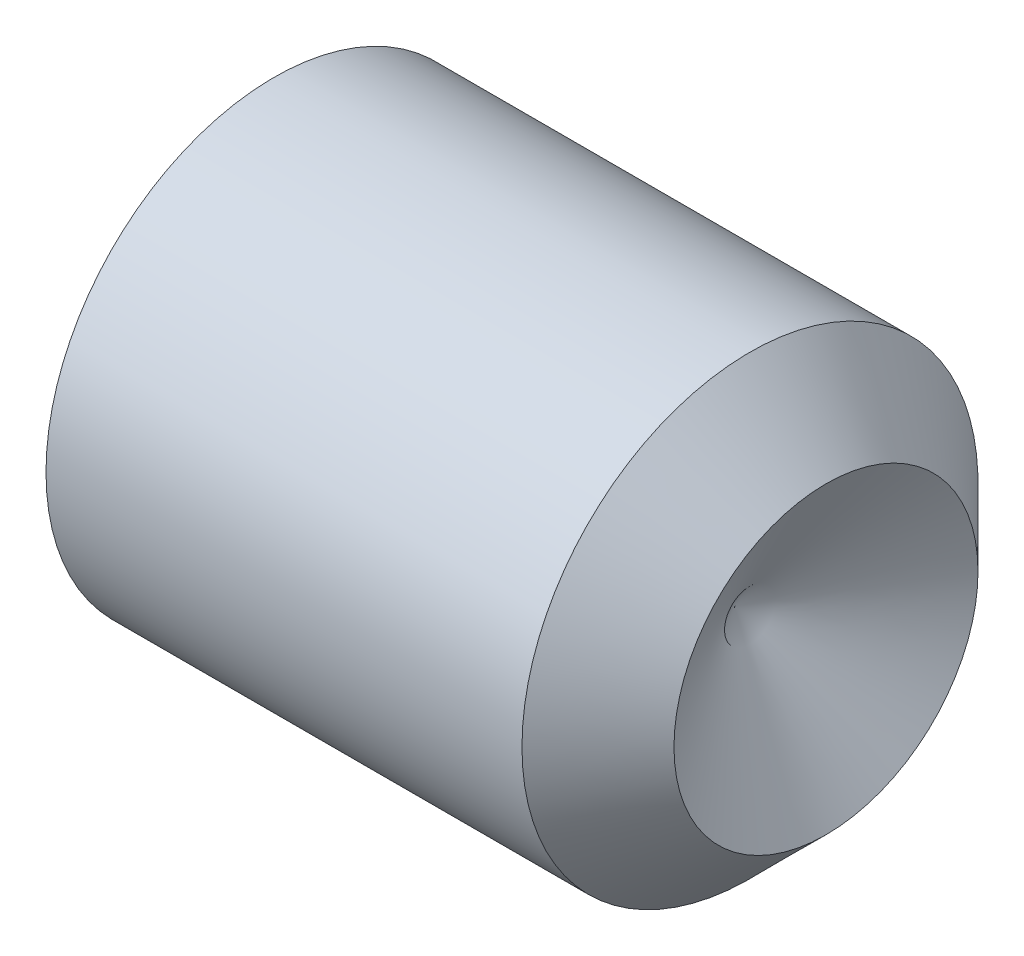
ISO-10303-21;
HEADER;
FILE_DESCRIPTION(('STEP AP214'),'2;1');
FILE_NAME('part.step','',(''),(''),'','','');
FILE_SCHEMA(('AUTOMOTIVE_DESIGN { 1 0 10303 214 1 1 1 1 }'));
ENDSEC;
DATA;
#1=APPLICATION_CONTEXT('core data for automotive mechanical design processes');
#2=APPLICATION_PROTOCOL_DEFINITION('international standard','automotive_design',2000,#1);
#3=PRODUCT_CONTEXT('',#1,'mechanical');
#4=PRODUCT('Part','Part','',(#3));
#5=PRODUCT_RELATED_PRODUCT_CATEGORY('part','',(#4));
#6=PRODUCT_DEFINITION_FORMATION('','',#4);
#7=PRODUCT_DEFINITION_CONTEXT('part definition',#1,'design');
#8=PRODUCT_DEFINITION('design','',#6,#7);
#9=PRODUCT_DEFINITION_SHAPE('','',#8);
#10=(LENGTH_UNIT() NAMED_UNIT(*) SI_UNIT(.MILLI.,.METRE.));
#11=(NAMED_UNIT(*) PLANE_ANGLE_UNIT() SI_UNIT($,.RADIAN.));
#12=(NAMED_UNIT(*) SI_UNIT($,.STERADIAN.) SOLID_ANGLE_UNIT());
#13=UNCERTAINTY_MEASURE_WITH_UNIT(LENGTH_MEASURE(1.E-05),#10,'distance_accuracy_value','');
#14=(GEOMETRIC_REPRESENTATION_CONTEXT(3) GLOBAL_UNCERTAINTY_ASSIGNED_CONTEXT((#13)) GLOBAL_UNIT_ASSIGNED_CONTEXT((#10,
#11,#12)) REPRESENTATION_CONTEXT('',''));
#15=CARTESIAN_POINT('',(0.,0.,0.));
#16=DIRECTION('',(0.,0.,1.));
#17=DIRECTION('',(1.,0.,0.));
#18=AXIS2_PLACEMENT_3D('',#15,#16,#17);
#19=CARTESIAN_POINT('',(0.,0.,0.));
#20=DIRECTION('',(-1.,0.,0.));
#21=DIRECTION('',(0.,0.,1.));
#22=AXIS2_PLACEMENT_3D('',#19,#20,#21);
#23=PLANE('',#22);
#24=CARTESIAN_POINT('',(1.13686837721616E-10,0.,0.));
#25=DIRECTION('',(-1.,0.,0.));
#26=DIRECTION('',(0.,0.,1.));
#27=AXIS2_PLACEMENT_3D('',#24,#25,#26);
#28=CIRCLE('',#27,7.671);
#29=CARTESIAN_POINT('',(1.13686837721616E-10,-4.04156163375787,6.5199709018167));
#30=VERTEX_POINT('',#29);
#31=CARTESIAN_POINT('',(1.13686837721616E-10,4.04156163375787,6.5199709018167));
#32=VERTEX_POINT('',#31);
#33=EDGE_CURVE('E264',#30,#32,#28,.T.);
#34=ORIENTED_EDGE('',*,*,#33,.F.);
#35=DIRECTION('',(0.,-0.707106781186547,0.707106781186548));
#36=VECTOR('',#35,1.);
#37=CARTESIAN_POINT('',(1.13686837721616E-10,-3.33188715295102,5.81029642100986));
#38=LINE('',#37,#36);
#39=CARTESIAN_POINT('',(1.13686837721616E-10,-3.33188715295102,5.81029642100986));
#40=VERTEX_POINT('',#39);
#41=EDGE_CURVE('E242',#40,#30,#38,.T.);
#42=ORIENTED_EDGE('',*,*,#41,.F.);
#43=DIRECTION('',(0.,0.707106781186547,0.707106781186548));
#44=VECTOR('',#43,1.);
#45=CARTESIAN_POINT('',(1.13686837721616E-10,-3.33188715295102,5.81029642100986));
#46=LINE('',#45,#44);
#47=CARTESIAN_POINT('',(1.13686837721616E-10,-5.81029642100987,3.331887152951));
#48=VERTEX_POINT('',#47);
#49=EDGE_CURVE('E256',#48,#40,#46,.T.);
#50=ORIENTED_EDGE('',*,*,#49,.F.);
#51=DIRECTION('',(0.,0.707106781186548,-0.707106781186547));
#52=VECTOR('',#51,1.);
#53=CARTESIAN_POINT('',(1.13686837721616E-10,-5.81029642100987,3.331887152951));
#54=LINE('',#53,#52);
#55=CARTESIAN_POINT('',(1.13686837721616E-10,-6.51997090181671,4.04156163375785));
#56=VERTEX_POINT('',#55);
#57=EDGE_CURVE('E253',#56,#48,#54,.T.);
#58=ORIENTED_EDGE('',*,*,#57,.F.);
#59=CARTESIAN_POINT('',(1.13686837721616E-10,0.,0.));
#60=DIRECTION('',(-1.,0.,0.));
#61=DIRECTION('',(0.,-1.,0.));
#62=AXIS2_PLACEMENT_3D('',#59,#60,#61);
#63=CIRCLE('',#62,7.671);
#64=CARTESIAN_POINT('',(1.13686837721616E-10,-6.51997090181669,-4.04156163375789));
#65=VERTEX_POINT('',#64);
#66=EDGE_CURVE('E232',#65,#56,#63,.T.);
#67=ORIENTED_EDGE('',*,*,#66,.F.);
#68=DIRECTION('',(0.,-0.707106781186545,-0.70710678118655));
#69=VECTOR('',#68,1.);
#70=CARTESIAN_POINT('',(1.13686837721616E-10,-5.81029642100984,-3.33188715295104));
#71=LINE('',#70,#69);
#72=CARTESIAN_POINT('',(1.13686837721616E-10,-5.81029642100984,-3.33188715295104));
#73=VERTEX_POINT('',#72);
#74=EDGE_CURVE('E210',#73,#65,#71,.T.);
#75=ORIENTED_EDGE('',*,*,#74,.F.);
#76=DIRECTION('',(0.,-0.707106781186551,0.707106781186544));
#77=VECTOR('',#76,1.);
#78=CARTESIAN_POINT('',(1.13686837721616E-10,-5.81029642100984,-3.33188715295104));
#79=LINE('',#78,#77);
#80=CARTESIAN_POINT('',(1.13686837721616E-10,-3.33188715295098,-5.81029642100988));
#81=VERTEX_POINT('',#80);
#82=EDGE_CURVE('E225',#81,#73,#79,.T.);
#83=ORIENTED_EDGE('',*,*,#82,.F.);
#84=DIRECTION('',(0.,0.707106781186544,0.707106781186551));
#85=VECTOR('',#84,1.);
#86=CARTESIAN_POINT('',(1.13686837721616E-10,-3.33188715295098,-5.81029642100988));
#87=LINE('',#86,#85);
#88=CARTESIAN_POINT('',(1.13686837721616E-10,-4.04156163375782,-6.51997090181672));
#89=VERTEX_POINT('',#88);
#90=EDGE_CURVE('E222',#89,#81,#87,.T.);
#91=ORIENTED_EDGE('',*,*,#90,.F.);
#92=CARTESIAN_POINT('',(1.13686837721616E-10,0.,0.));
#93=DIRECTION('',(-1.,0.,0.));
#94=DIRECTION('',(0.,0.,-1.));
#95=AXIS2_PLACEMENT_3D('',#92,#93,#94);
#96=CIRCLE('',#95,7.671);
#97=CARTESIAN_POINT('',(1.13686837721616E-10,4.04156163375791,-6.51997090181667));
#98=VERTEX_POINT('',#97);
#99=EDGE_CURVE('E202',#98,#89,#96,.T.);
#100=ORIENTED_EDGE('',*,*,#99,.F.);
#101=DIRECTION('',(0.,0.707106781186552,-0.707106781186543));
#102=VECTOR('',#101,1.);
#103=CARTESIAN_POINT('',(1.13686837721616E-10,3.33188715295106,-5.81029642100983));
#104=LINE('',#103,#102);
#105=CARTESIAN_POINT('',(1.13686837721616E-10,3.33188715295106,-5.81029642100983));
#106=VERTEX_POINT('',#105);
#107=EDGE_CURVE('E187',#106,#98,#104,.T.);
#108=ORIENTED_EDGE('',*,*,#107,.F.);
#109=DIRECTION('',(0.,-0.707106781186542,-0.707106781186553));
#110=VECTOR('',#109,1.);
#111=CARTESIAN_POINT('',(1.13686837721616E-10,3.33188715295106,-5.81029642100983));
#112=LINE('',#111,#110);
#113=CARTESIAN_POINT('',(1.13686837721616E-10,5.81029642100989,-3.33188715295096));
#114=VERTEX_POINT('',#113);
#115=EDGE_CURVE('E191',#114,#106,#112,.T.);
#116=ORIENTED_EDGE('',*,*,#115,.F.);
#117=DIRECTION('',(0.,-0.707106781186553,0.707106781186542));
#118=VECTOR('',#117,1.);
#119=CARTESIAN_POINT('',(1.13686837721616E-10,5.81029642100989,-3.33188715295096));
#120=LINE('',#119,#118);
#121=CARTESIAN_POINT('',(1.13686837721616E-10,6.51997090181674,-4.0415616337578));
#122=VERTEX_POINT('',#121);
#123=EDGE_CURVE('E196',#122,#114,#120,.T.);
#124=ORIENTED_EDGE('',*,*,#123,.F.);
#125=CARTESIAN_POINT('',(1.13686837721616E-10,0.,0.));
#126=DIRECTION('',(-1.,0.,0.));
#127=DIRECTION('',(0.,0.,-1.));
#128=AXIS2_PLACEMENT_3D('',#125,#126,#127);
#129=CIRCLE('',#128,7.671);
#130=CARTESIAN_POINT('',(1.13686837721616E-10,6.51997090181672,4.04156163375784));
#131=VERTEX_POINT('',#130);
#132=EDGE_CURVE('E177',#131,#122,#129,.T.);
#133=ORIENTED_EDGE('',*,*,#132,.F.);
#134=DIRECTION('',(0.,0.70710678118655,0.707106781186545));
#135=VECTOR('',#134,1.);
#136=CARTESIAN_POINT('',(1.13686837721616E-10,5.81029642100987,3.331887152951));
#137=LINE('',#136,#135);
#138=CARTESIAN_POINT('',(1.13686837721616E-10,5.81029642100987,3.331887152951));
#139=VERTEX_POINT('',#138);
#140=EDGE_CURVE('E286',#139,#131,#137,.T.);
#141=ORIENTED_EDGE('',*,*,#140,.F.);
#142=DIRECTION('',(0.,0.707106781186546,-0.707106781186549));
#143=VECTOR('',#142,1.);
#144=CARTESIAN_POINT('',(1.13686837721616E-10,5.81029642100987,3.331887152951));
#145=LINE('',#144,#143);
#146=CARTESIAN_POINT('',(1.13686837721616E-10,3.33188715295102,5.81029642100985));
#147=VERTEX_POINT('',#146);
#148=EDGE_CURVE('E283',#147,#139,#145,.T.);
#149=ORIENTED_EDGE('',*,*,#148,.F.);
#150=DIRECTION('',(0.,-0.707106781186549,-0.707106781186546));
#151=VECTOR('',#150,1.);
#152=CARTESIAN_POINT('',(1.13686837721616E-10,3.33188715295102,5.81029642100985));
#153=LINE('',#152,#151);
#154=EDGE_CURVE('E280',#32,#147,#153,.T.);
#155=ORIENTED_EDGE('',*,*,#154,.F.);
#156=EDGE_LOOP('',(#34,#42,#50,#58,#67,#75,#83,#91,#100,#108,#116,#124,#133,#141,#149,#155));
#157=FACE_BOUND('',#156,.T.);
#158=CARTESIAN_POINT('',(0.,0.,0.));
#159=DIRECTION('',(-1.,0.,0.));
#160=DIRECTION('',(0.,0.,1.));
#161=AXIS2_PLACEMENT_3D('',#158,#159,#160);
#162=CIRCLE('',#161,10.352);
#163=CARTESIAN_POINT('',(0.,0.,10.352));
#164=VERTEX_POINT('',#163);
#165=EDGE_CURVE('E11',#164,#164,#162,.T.);
#166=ORIENTED_EDGE('',*,*,#165,.T.);
#167=EDGE_LOOP('',(#166));
#168=FACE_BOUND('',#167,.T.);
#169=ADVANCED_FACE('F45',(#157,#168),#23,.T.);
#170=CARTESIAN_POINT('',(0.,0.,0.));
#171=DIRECTION('',(1.,0.,0.));
#172=DIRECTION('',(0.,0.,-1.));
#173=AXIS2_PLACEMENT_3D('',#170,#171,#172);
#174=CONICAL_SURFACE('',#173,10.352,1.0471975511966);
#175=CARTESIAN_POINT('',(0.951473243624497,0.,0.));
#176=DIRECTION('',(-1.,0.,0.));
#177=DIRECTION('',(0.,0.,1.));
#178=AXIS2_PLACEMENT_3D('',#175,#176,#177);
#179=CIRCLE('',#178,12.);
#180=CARTESIAN_POINT('',(0.951473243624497,0.,12.));
#181=VERTEX_POINT('',#180);
#182=EDGE_CURVE('E52',#181,#181,#179,.T.);
#183=ORIENTED_EDGE('',*,*,#182,.T.);
#184=EDGE_LOOP('',(#183));
#185=FACE_BOUND('',#184,.T.);
#186=ORIENTED_EDGE('',*,*,#165,.F.);
#187=EDGE_LOOP('',(#186));
#188=FACE_BOUND('',#187,.T.);
#189=ADVANCED_FACE('F303',(#185,#188),#174,.T.);
#190=CARTESIAN_POINT('',(-12.7,0.,0.));
#191=DIRECTION('',(-1.,0.,0.));
#192=DIRECTION('',(0.,0.,1.));
#193=AXIS2_PLACEMENT_3D('',#190,#191,#192);
#194=CYLINDRICAL_SURFACE('',#193,12.);
#195=CARTESIAN_POINT('',(26.,0.,0.));
#196=DIRECTION('',(-1.,0.,0.));
#197=DIRECTION('',(0.,0.,1.));
#198=AXIS2_PLACEMENT_3D('',#195,#196,#197);
#199=CIRCLE('',#198,12.);
#200=CARTESIAN_POINT('',(26.,0.,12.));
#201=VERTEX_POINT('',#200);
#202=EDGE_CURVE('E298',#201,#201,#199,.T.);
#203=ORIENTED_EDGE('',*,*,#202,.T.);
#204=EDGE_LOOP('',(#203));
#205=FACE_BOUND('',#204,.T.);
#206=ORIENTED_EDGE('',*,*,#182,.F.);
#207=EDGE_LOOP('',(#206));
#208=FACE_BOUND('',#207,.T.);
#209=ADVANCED_FACE('F306',(#205,#208),#194,.T.);
#210=CARTESIAN_POINT('',(26.,0.,0.));
#211=DIRECTION('',(-1.,0.,0.));
#212=DIRECTION('',(0.,0.,1.));
#213=AXIS2_PLACEMENT_3D('',#210,#211,#212);
#214=CONICAL_SURFACE('',#213,12.,0.785398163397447);
#215=CARTESIAN_POINT('',(30.,0.,0.));
#216=DIRECTION('',(-1.,0.,0.));
#217=DIRECTION('',(0.,0.,1.));
#218=AXIS2_PLACEMENT_3D('',#215,#216,#217);
#219=CIRCLE('',#218,8.);
#220=CARTESIAN_POINT('',(30.,0.,8.));
#221=VERTEX_POINT('',#220);
#222=EDGE_CURVE('E290',#221,#221,#219,.T.);
#223=ORIENTED_EDGE('',*,*,#222,.T.);
#224=EDGE_LOOP('',(#223));
#225=FACE_BOUND('',#224,.T.);
#226=ORIENTED_EDGE('',*,*,#202,.F.);
#227=EDGE_LOOP('',(#226));
#228=FACE_BOUND('',#227,.T.);
#229=ADVANCED_FACE('F308',(#225,#228),#214,.T.);
#230=CARTESIAN_POINT('',(25.1931150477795,0.,0.));
#231=DIRECTION('',(1.,0.,0.));
#232=DIRECTION('',(0.,0.,-1.));
#233=AXIS2_PLACEMENT_3D('',#230,#231,#232);
#234=CONICAL_SURFACE('',#233,0.,1.02974425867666);
#235=ORIENTED_EDGE('',*,*,#222,.F.);
#236=EDGE_LOOP('',(#235));
#237=FACE_BOUND('',#236,.T.);
#238=CARTESIAN_POINT('',(25.1931150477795,0.,0.));
#239=VERTEX_POINT('',#238);
#240=VERTEX_LOOP('',#239);
#241=FACE_BOUND('',#240,.T.);
#242=ADVANCED_FACE('F315',(#237,#241),#234,.F.);
#243=CARTESIAN_POINT('',(12.0000000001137,0.,0.));
#244=DIRECTION('',(-1.,0.,0.));
#245=DIRECTION('',(0.,0.,1.));
#246=AXIS2_PLACEMENT_3D('',#243,#244,#245);
#247=CYLINDRICAL_SURFACE('',#246,7.671);
#248=ORIENTED_EDGE('',*,*,#132,.T.);
#249=DIRECTION('',(-1.,0.,0.));
#250=VECTOR('',#249,1.);
#251=CARTESIAN_POINT('',(12.0000000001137,6.51997090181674,-4.0415616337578));
#252=LINE('',#251,#250);
#253=CARTESIAN_POINT('',(12.0000000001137,6.51997090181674,-4.0415616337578));
#254=VERTEX_POINT('',#253);
#255=EDGE_CURVE('E174',#254,#122,#252,.T.);
#256=ORIENTED_EDGE('',*,*,#255,.F.);
#257=CARTESIAN_POINT('',(12.0000000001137,0.,0.));
#258=DIRECTION('',(-1.,0.,0.));
#259=DIRECTION('',(0.,0.,-1.));
#260=AXIS2_PLACEMENT_3D('',#257,#258,#259);
#261=CIRCLE('',#260,7.671);
#262=CARTESIAN_POINT('',(12.0000000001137,6.51997090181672,4.04156163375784));
#263=VERTEX_POINT('',#262);
#264=EDGE_CURVE('E163',#263,#254,#261,.T.);
#265=ORIENTED_EDGE('',*,*,#264,.F.);
#266=DIRECTION('',(-1.,0.,0.));
#267=VECTOR('',#266,1.);
#268=CARTESIAN_POINT('',(12.0000000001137,6.51997090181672,4.04156163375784));
#269=LINE('',#268,#267);
#270=EDGE_CURVE('E63',#263,#131,#269,.T.);
#271=ORIENTED_EDGE('',*,*,#270,.T.);
#272=EDGE_LOOP('',(#248,#256,#265,#271));
#273=FACE_BOUND('',#272,.T.);
#274=ADVANCED_FACE('F175',(#273),#247,.F.);
#275=CARTESIAN_POINT('',(12.0000000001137,5.81029642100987,3.331887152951));
#276=DIRECTION('',(0.,-0.707106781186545,0.70710678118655));
#277=DIRECTION('',(0.,-0.70710678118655,-0.707106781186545));
#278=AXIS2_PLACEMENT_3D('',#275,#276,#277);
#279=PLANE('',#278);
#280=ORIENTED_EDGE('',*,*,#140,.T.);
#281=ORIENTED_EDGE('',*,*,#270,.F.);
#282=DIRECTION('',(0.,0.70710678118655,0.707106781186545));
#283=VECTOR('',#282,1.);
#284=CARTESIAN_POINT('',(12.0000000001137,5.81029642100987,3.331887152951));
#285=LINE('',#284,#283);
#286=CARTESIAN_POINT('',(12.0000000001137,5.81029642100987,3.331887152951));
#287=VERTEX_POINT('',#286);
#288=EDGE_CURVE('E171',#287,#263,#285,.T.);
#289=ORIENTED_EDGE('',*,*,#288,.F.);
#290=DIRECTION('',(-1.,0.,0.));
#291=VECTOR('',#290,1.);
#292=CARTESIAN_POINT('',(12.0000000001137,5.81029642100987,3.331887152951));
#293=LINE('',#292,#291);
#294=EDGE_CURVE('E291',#287,#139,#293,.T.);
#295=ORIENTED_EDGE('',*,*,#294,.T.);
#296=EDGE_LOOP('',(#280,#281,#289,#295));
#297=FACE_BOUND('',#296,.T.);
#298=ADVANCED_FACE('F371',(#297),#279,.F.);
#299=CARTESIAN_POINT('',(12.0000000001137,5.81029642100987,3.331887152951));
#300=DIRECTION('',(0.,0.707106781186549,0.707106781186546));
#301=DIRECTION('',(0.,-0.707106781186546,0.707106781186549));
#302=AXIS2_PLACEMENT_3D('',#299,#300,#301);
#303=PLANE('',#302);
#304=ORIENTED_EDGE('',*,*,#148,.T.);
#305=ORIENTED_EDGE('',*,*,#294,.F.);
#306=DIRECTION('',(0.,0.707106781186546,-0.707106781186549));
#307=VECTOR('',#306,1.);
#308=CARTESIAN_POINT('',(12.0000000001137,5.81029642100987,3.331887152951));
#309=LINE('',#308,#307);
#310=CARTESIAN_POINT('',(12.0000000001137,3.33188715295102,5.81029642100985));
#311=VERTEX_POINT('',#310);
#312=EDGE_CURVE('E276',#311,#287,#309,.T.);
#313=ORIENTED_EDGE('',*,*,#312,.F.);
#314=DIRECTION('',(-1.,0.,0.));
#315=VECTOR('',#314,1.);
#316=CARTESIAN_POINT('',(12.0000000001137,3.33188715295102,5.81029642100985));
#317=LINE('',#316,#315);
#318=EDGE_CURVE('E293',#311,#147,#317,.T.);
#319=ORIENTED_EDGE('',*,*,#318,.T.);
#320=EDGE_LOOP('',(#304,#305,#313,#319));
#321=FACE_BOUND('',#320,.T.);
#322=ADVANCED_FACE('F374',(#321),#303,.F.);
#323=CARTESIAN_POINT('',(12.0000000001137,3.33188715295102,5.81029642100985));
#324=DIRECTION('',(0.,0.707106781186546,-0.707106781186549));
#325=DIRECTION('',(0.,0.707106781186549,0.707106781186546));
#326=AXIS2_PLACEMENT_3D('',#323,#324,#325);
#327=PLANE('',#326);
#328=ORIENTED_EDGE('',*,*,#154,.T.);
#329=ORIENTED_EDGE('',*,*,#318,.F.);
#330=DIRECTION('',(0.,-0.707106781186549,-0.707106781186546));
#331=VECTOR('',#330,1.);
#332=CARTESIAN_POINT('',(12.0000000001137,3.33188715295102,5.81029642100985));
#333=LINE('',#332,#331);
#334=CARTESIAN_POINT('',(12.0000000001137,4.04156163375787,6.5199709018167));
#335=VERTEX_POINT('',#334);
#336=EDGE_CURVE('E273',#335,#311,#333,.T.);
#337=ORIENTED_EDGE('',*,*,#336,.F.);
#338=DIRECTION('',(-1.,0.,0.));
#339=VECTOR('',#338,1.);
#340=CARTESIAN_POINT('',(12.0000000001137,4.04156163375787,6.5199709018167));
#341=LINE('',#340,#339);
#342=EDGE_CURVE('E89',#335,#32,#341,.T.);
#343=ORIENTED_EDGE('',*,*,#342,.T.);
#344=EDGE_LOOP('',(#328,#329,#337,#343));
#345=FACE_BOUND('',#344,.T.);
#346=ADVANCED_FACE('F376',(#345),#327,.F.);
#347=CARTESIAN_POINT('',(12.0000000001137,0.,0.));
#348=DIRECTION('',(-1.,0.,0.));
#349=DIRECTION('',(0.,0.,1.));
#350=AXIS2_PLACEMENT_3D('',#347,#348,#349);
#351=CYLINDRICAL_SURFACE('',#350,7.671);
#352=ORIENTED_EDGE('',*,*,#33,.T.);
#353=ORIENTED_EDGE('',*,*,#342,.F.);
#354=CARTESIAN_POINT('',(12.0000000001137,0.,0.));
#355=DIRECTION('',(-1.,0.,0.));
#356=DIRECTION('',(0.,0.,1.));
#357=AXIS2_PLACEMENT_3D('',#354,#355,#356);
#358=CIRCLE('',#357,7.671);
#359=CARTESIAN_POINT('',(12.0000000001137,-4.04156163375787,6.5199709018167));
#360=VERTEX_POINT('',#359);
#361=EDGE_CURVE('E270',#360,#335,#358,.T.);
#362=ORIENTED_EDGE('',*,*,#361,.F.);
#363=DIRECTION('',(-1.,0.,0.));
#364=VECTOR('',#363,1.);
#365=CARTESIAN_POINT('',(12.0000000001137,-4.04156163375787,6.5199709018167));
#366=LINE('',#365,#364);
#367=EDGE_CURVE('E261',#360,#30,#366,.T.);
#368=ORIENTED_EDGE('',*,*,#367,.T.);
#369=EDGE_LOOP('',(#352,#353,#362,#368));
#370=FACE_BOUND('',#369,.T.);
#371=ADVANCED_FACE('F332',(#370),#351,.F.);
#372=CARTESIAN_POINT('',(12.0000000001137,0.,0.));
#373=DIRECTION('',(1.,0.,0.));
#374=DIRECTION('',(0.,0.,-1.));
#375=AXIS2_PLACEMENT_3D('',#372,#373,#374);
#376=PLANE('',#375);
#377=DIRECTION('',(0.,-0.707106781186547,0.707106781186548));
#378=VECTOR('',#377,1.);
#379=CARTESIAN_POINT('',(12.0000000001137,-3.33188715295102,5.81029642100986));
#380=LINE('',#379,#378);
#381=CARTESIAN_POINT('',(12.0000000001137,-3.33188715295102,5.81029642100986));
#382=VERTEX_POINT('',#381);
#383=EDGE_CURVE('E248',#382,#360,#380,.T.);
#384=ORIENTED_EDGE('',*,*,#383,.T.);
#385=ORIENTED_EDGE('',*,*,#361,.T.);
#386=ORIENTED_EDGE('',*,*,#336,.T.);
#387=ORIENTED_EDGE('',*,*,#312,.T.);
#388=ORIENTED_EDGE('',*,*,#288,.T.);
#389=ORIENTED_EDGE('',*,*,#264,.T.);
#390=DIRECTION('',(0.,-0.707106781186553,0.707106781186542));
#391=VECTOR('',#390,1.);
#392=CARTESIAN_POINT('',(12.0000000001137,5.81029642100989,-3.33188715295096));
#393=LINE('',#392,#391);
#394=CARTESIAN_POINT('',(12.0000000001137,5.81029642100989,-3.33188715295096));
#395=VERTEX_POINT('',#394);
#396=EDGE_CURVE('E169',#254,#395,#393,.T.);
#397=ORIENTED_EDGE('',*,*,#396,.T.);
#398=DIRECTION('',(0.,-0.707106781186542,-0.707106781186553));
#399=VECTOR('',#398,1.);
#400=CARTESIAN_POINT('',(12.0000000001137,3.33188715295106,-5.81029642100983));
#401=LINE('',#400,#399);
#402=CARTESIAN_POINT('',(12.0000000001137,3.33188715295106,-5.81029642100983));
#403=VERTEX_POINT('',#402);
#404=EDGE_CURVE('E186',#395,#403,#401,.T.);
#405=ORIENTED_EDGE('',*,*,#404,.T.);
#406=DIRECTION('',(0.,0.707106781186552,-0.707106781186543));
#407=VECTOR('',#406,1.);
#408=CARTESIAN_POINT('',(12.0000000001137,3.33188715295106,-5.81029642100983));
#409=LINE('',#408,#407);
#410=CARTESIAN_POINT('',(12.0000000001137,4.04156163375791,-6.51997090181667));
#411=VERTEX_POINT('',#410);
#412=EDGE_CURVE('E182',#403,#411,#409,.T.);
#413=ORIENTED_EDGE('',*,*,#412,.T.);
#414=CARTESIAN_POINT('',(12.0000000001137,0.,0.));
#415=DIRECTION('',(-1.,0.,0.));
#416=DIRECTION('',(0.,0.,-1.));
#417=AXIS2_PLACEMENT_3D('',#414,#415,#416);
#418=CIRCLE('',#417,7.671);
#419=CARTESIAN_POINT('',(12.0000000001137,-4.04156163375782,-6.51997090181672));
#420=VERTEX_POINT('',#419);
#421=EDGE_CURVE('E206',#411,#420,#418,.T.);
#422=ORIENTED_EDGE('',*,*,#421,.T.);
#423=DIRECTION('',(0.,0.707106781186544,0.707106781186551));
#424=VECTOR('',#423,1.);
#425=CARTESIAN_POINT('',(12.0000000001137,-3.33188715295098,-5.81029642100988));
#426=LINE('',#425,#424);
#427=CARTESIAN_POINT('',(12.0000000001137,-3.33188715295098,-5.81029642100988));
#428=VERTEX_POINT('',#427);
#429=EDGE_CURVE('E209',#420,#428,#426,.T.);
#430=ORIENTED_EDGE('',*,*,#429,.T.);
#431=DIRECTION('',(0.,-0.707106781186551,0.707106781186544));
#432=VECTOR('',#431,1.);
#433=CARTESIAN_POINT('',(12.0000000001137,-5.81029642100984,-3.33188715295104));
#434=LINE('',#433,#432);
#435=CARTESIAN_POINT('',(12.0000000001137,-5.81029642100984,-3.33188715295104));
#436=VERTEX_POINT('',#435);
#437=EDGE_CURVE('E213',#428,#436,#434,.T.);
#438=ORIENTED_EDGE('',*,*,#437,.T.);
#439=DIRECTION('',(0.,-0.707106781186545,-0.70710678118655));
#440=VECTOR('',#439,1.);
#441=CARTESIAN_POINT('',(12.0000000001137,-5.81029642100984,-3.33188715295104));
#442=LINE('',#441,#440);
#443=CARTESIAN_POINT('',(12.0000000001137,-6.51997090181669,-4.04156163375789));
#444=VERTEX_POINT('',#443);
#445=EDGE_CURVE('E216',#436,#444,#442,.T.);
#446=ORIENTED_EDGE('',*,*,#445,.T.);
#447=CARTESIAN_POINT('',(12.0000000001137,0.,0.));
#448=DIRECTION('',(-1.,0.,0.));
#449=DIRECTION('',(0.,-1.,0.));
#450=AXIS2_PLACEMENT_3D('',#447,#448,#449);
#451=CIRCLE('',#450,7.671);
#452=CARTESIAN_POINT('',(12.0000000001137,-6.51997090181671,4.04156163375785));
#453=VERTEX_POINT('',#452);
#454=EDGE_CURVE('E238',#444,#453,#451,.T.);
#455=ORIENTED_EDGE('',*,*,#454,.T.);
#456=DIRECTION('',(0.,0.707106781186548,-0.707106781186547));
#457=VECTOR('',#456,1.);
#458=CARTESIAN_POINT('',(12.0000000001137,-5.81029642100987,3.331887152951));
#459=LINE('',#458,#457);
#460=CARTESIAN_POINT('',(12.0000000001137,-5.81029642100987,3.331887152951));
#461=VERTEX_POINT('',#460);
#462=EDGE_CURVE('E241',#453,#461,#459,.T.);
#463=ORIENTED_EDGE('',*,*,#462,.T.);
#464=DIRECTION('',(0.,0.707106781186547,0.707106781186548));
#465=VECTOR('',#464,1.);
#466=CARTESIAN_POINT('',(12.0000000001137,-3.33188715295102,5.81029642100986));
#467=LINE('',#466,#465);
#468=EDGE_CURVE('E245',#461,#382,#467,.T.);
#469=ORIENTED_EDGE('',*,*,#468,.T.);
#470=EDGE_LOOP('',(#384,#385,#386,#387,#388,#389,#397,#405,#413,#422,#430,#438,#446,#455,#463,#469));
#471=FACE_BOUND('',#470,.T.);
#472=ADVANCED_FACE('F166',(#471),#376,.F.);
#473=CARTESIAN_POINT('',(12.0000000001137,-3.33188715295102,5.81029642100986));
#474=DIRECTION('',(0.,-0.707106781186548,-0.707106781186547));
#475=DIRECTION('',(0.,0.707106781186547,-0.707106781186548));
#476=AXIS2_PLACEMENT_3D('',#473,#474,#475);
#477=PLANE('',#476);
#478=ORIENTED_EDGE('',*,*,#41,.T.);
#479=ORIENTED_EDGE('',*,*,#367,.F.);
#480=ORIENTED_EDGE('',*,*,#383,.F.);
#481=DIRECTION('',(-1.,0.,0.));
#482=VECTOR('',#481,1.);
#483=CARTESIAN_POINT('',(12.0000000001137,-3.33188715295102,5.81029642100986));
#484=LINE('',#483,#482);
#485=EDGE_CURVE('E265',#382,#40,#484,.T.);
#486=ORIENTED_EDGE('',*,*,#485,.T.);
#487=EDGE_LOOP('',(#478,#479,#480,#486));
#488=FACE_BOUND('',#487,.T.);
#489=ADVANCED_FACE('F335',(#488),#477,.F.);
#490=CARTESIAN_POINT('',(12.0000000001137,-3.33188715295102,5.81029642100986));
#491=DIRECTION('',(0.,-0.707106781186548,0.707106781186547));
#492=DIRECTION('',(0.,-0.707106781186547,-0.707106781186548));
#493=AXIS2_PLACEMENT_3D('',#490,#491,#492);
#494=PLANE('',#493);
#495=ORIENTED_EDGE('',*,*,#49,.T.);
#496=ORIENTED_EDGE('',*,*,#485,.F.);
#497=ORIENTED_EDGE('',*,*,#468,.F.);
#498=DIRECTION('',(-1.,0.,0.));
#499=VECTOR('',#498,1.);
#500=CARTESIAN_POINT('',(12.0000000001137,-5.81029642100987,3.331887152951));
#501=LINE('',#500,#499);
#502=EDGE_CURVE('E267',#461,#48,#501,.T.);
#503=ORIENTED_EDGE('',*,*,#502,.T.);
#504=EDGE_LOOP('',(#495,#496,#497,#503));
#505=FACE_BOUND('',#504,.T.);
#506=ADVANCED_FACE('F338',(#505),#494,.F.);
#507=CARTESIAN_POINT('',(12.0000000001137,-5.81029642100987,3.331887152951));
#508=DIRECTION('',(0.,0.707106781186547,0.707106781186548));
#509=DIRECTION('',(0.,-0.707106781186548,0.707106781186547));
#510=AXIS2_PLACEMENT_3D('',#507,#508,#509);
#511=PLANE('',#510);
#512=ORIENTED_EDGE('',*,*,#57,.T.);
#513=ORIENTED_EDGE('',*,*,#502,.F.);
#514=ORIENTED_EDGE('',*,*,#462,.F.);
#515=DIRECTION('',(-1.,0.,0.));
#516=VECTOR('',#515,1.);
#517=CARTESIAN_POINT('',(12.0000000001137,-6.51997090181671,4.04156163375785));
#518=LINE('',#517,#516);
#519=EDGE_CURVE('E250',#453,#56,#518,.T.);
#520=ORIENTED_EDGE('',*,*,#519,.T.);
#521=EDGE_LOOP('',(#512,#513,#514,#520));
#522=FACE_BOUND('',#521,.T.);
#523=ADVANCED_FACE('F343',(#522),#511,.F.);
#524=CARTESIAN_POINT('',(12.0000000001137,0.,0.));
#525=DIRECTION('',(-1.,0.,0.));
#526=DIRECTION('',(0.,0.,1.));
#527=AXIS2_PLACEMENT_3D('',#524,#525,#526);
#528=CYLINDRICAL_SURFACE('',#527,7.671);
#529=ORIENTED_EDGE('',*,*,#66,.T.);
#530=ORIENTED_EDGE('',*,*,#519,.F.);
#531=ORIENTED_EDGE('',*,*,#454,.F.);
#532=DIRECTION('',(-1.,0.,0.));
#533=VECTOR('',#532,1.);
#534=CARTESIAN_POINT('',(12.0000000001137,-6.51997090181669,-4.04156163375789));
#535=LINE('',#534,#533);
#536=EDGE_CURVE('E230',#444,#65,#535,.T.);
#537=ORIENTED_EDGE('',*,*,#536,.T.);
#538=EDGE_LOOP('',(#529,#530,#531,#537));
#539=FACE_BOUND('',#538,.T.);
#540=ADVANCED_FACE('F346',(#539),#528,.F.);
#541=CARTESIAN_POINT('',(12.0000000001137,-5.81029642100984,-3.33188715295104));
#542=DIRECTION('',(0.,0.70710678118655,-0.707106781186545));
#543=DIRECTION('',(0.,0.707106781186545,0.70710678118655));
#544=AXIS2_PLACEMENT_3D('',#541,#542,#543);
#545=PLANE('',#544);
#546=ORIENTED_EDGE('',*,*,#74,.T.);
#547=ORIENTED_EDGE('',*,*,#536,.F.);
#548=ORIENTED_EDGE('',*,*,#445,.F.);
#549=DIRECTION('',(-1.,0.,0.));
#550=VECTOR('',#549,1.);
#551=CARTESIAN_POINT('',(12.0000000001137,-5.81029642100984,-3.33188715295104));
#552=LINE('',#551,#550);
#553=EDGE_CURVE('E233',#436,#73,#552,.T.);
#554=ORIENTED_EDGE('',*,*,#553,.T.);
#555=EDGE_LOOP('',(#546,#547,#548,#554));
#556=FACE_BOUND('',#555,.T.);
#557=ADVANCED_FACE('F350',(#556),#545,.F.);
#558=CARTESIAN_POINT('',(12.0000000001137,-5.81029642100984,-3.33188715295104));
#559=DIRECTION('',(0.,-0.707106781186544,-0.707106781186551));
#560=DIRECTION('',(0.,0.707106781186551,-0.707106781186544));
#561=AXIS2_PLACEMENT_3D('',#558,#559,#560);
#562=PLANE('',#561);
#563=ORIENTED_EDGE('',*,*,#82,.T.);
#564=ORIENTED_EDGE('',*,*,#553,.F.);
#565=ORIENTED_EDGE('',*,*,#437,.F.);
#566=DIRECTION('',(-1.,0.,0.));
#567=VECTOR('',#566,1.);
#568=CARTESIAN_POINT('',(12.0000000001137,-3.33188715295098,-5.81029642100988));
#569=LINE('',#568,#567);
#570=EDGE_CURVE('E235',#428,#81,#569,.T.);
#571=ORIENTED_EDGE('',*,*,#570,.T.);
#572=EDGE_LOOP('',(#563,#564,#565,#571));
#573=FACE_BOUND('',#572,.T.);
#574=ADVANCED_FACE('F355',(#573),#562,.F.);
#575=CARTESIAN_POINT('',(12.0000000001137,-3.33188715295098,-5.81029642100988));
#576=DIRECTION('',(0.,-0.707106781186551,0.707106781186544));
#577=DIRECTION('',(0.,-0.707106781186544,-0.707106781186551));
#578=AXIS2_PLACEMENT_3D('',#575,#576,#577);
#579=PLANE('',#578);
#580=ORIENTED_EDGE('',*,*,#90,.T.);
#581=ORIENTED_EDGE('',*,*,#570,.F.);
#582=ORIENTED_EDGE('',*,*,#429,.F.);
#583=DIRECTION('',(-1.,0.,0.));
#584=VECTOR('',#583,1.);
#585=CARTESIAN_POINT('',(12.0000000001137,-4.04156163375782,-6.51997090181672));
#586=LINE('',#585,#584);
#587=EDGE_CURVE('E219',#420,#89,#586,.T.);
#588=ORIENTED_EDGE('',*,*,#587,.T.);
#589=EDGE_LOOP('',(#580,#581,#582,#588));
#590=FACE_BOUND('',#589,.T.);
#591=ADVANCED_FACE('F359',(#590),#579,.F.);
#592=CARTESIAN_POINT('',(12.0000000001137,0.,0.));
#593=DIRECTION('',(-1.,0.,0.));
#594=DIRECTION('',(0.,0.,1.));
#595=AXIS2_PLACEMENT_3D('',#592,#593,#594);
#596=CYLINDRICAL_SURFACE('',#595,7.671);
#597=ORIENTED_EDGE('',*,*,#99,.T.);
#598=ORIENTED_EDGE('',*,*,#587,.F.);
#599=ORIENTED_EDGE('',*,*,#421,.F.);
#600=DIRECTION('',(-1.,0.,0.));
#601=VECTOR('',#600,1.);
#602=CARTESIAN_POINT('',(12.0000000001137,4.04156163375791,-6.51997090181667));
#603=LINE('',#602,#601);
#604=EDGE_CURVE('E200',#411,#98,#603,.T.);
#605=ORIENTED_EDGE('',*,*,#604,.T.);
#606=EDGE_LOOP('',(#597,#598,#599,#605));
#607=FACE_BOUND('',#606,.T.);
#608=ADVANCED_FACE('F361',(#607),#596,.F.);
#609=CARTESIAN_POINT('',(12.0000000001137,3.33188715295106,-5.81029642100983));
#610=DIRECTION('',(0.,0.707106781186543,0.707106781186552));
#611=DIRECTION('',(0.,-0.707106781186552,0.707106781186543));
#612=AXIS2_PLACEMENT_3D('',#609,#610,#611);
#613=PLANE('',#612);
#614=ORIENTED_EDGE('',*,*,#107,.T.);
#615=ORIENTED_EDGE('',*,*,#604,.F.);
#616=ORIENTED_EDGE('',*,*,#412,.F.);
#617=DIRECTION('',(-1.,0.,0.));
#618=VECTOR('',#617,1.);
#619=CARTESIAN_POINT('',(12.0000000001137,3.33188715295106,-5.81029642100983));
#620=LINE('',#619,#618);
#621=EDGE_CURVE('E203',#403,#106,#620,.T.);
#622=ORIENTED_EDGE('',*,*,#621,.T.);
#623=EDGE_LOOP('',(#614,#615,#616,#622));
#624=FACE_BOUND('',#623,.T.);
#625=ADVANCED_FACE('F366',(#624),#613,.F.);
#626=CARTESIAN_POINT('',(12.0000000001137,3.33188715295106,-5.81029642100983));
#627=DIRECTION('',(0.,0.707106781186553,-0.707106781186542));
#628=DIRECTION('',(0.,0.707106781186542,0.707106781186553));
#629=AXIS2_PLACEMENT_3D('',#626,#627,#628);
#630=PLANE('',#629);
#631=ORIENTED_EDGE('',*,*,#115,.T.);
#632=ORIENTED_EDGE('',*,*,#621,.F.);
#633=ORIENTED_EDGE('',*,*,#404,.F.);
#634=DIRECTION('',(-1.,0.,0.));
#635=VECTOR('',#634,1.);
#636=CARTESIAN_POINT('',(12.0000000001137,5.81029642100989,-3.33188715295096));
#637=LINE('',#636,#635);
#638=EDGE_CURVE('E181',#395,#114,#637,.T.);
#639=ORIENTED_EDGE('',*,*,#638,.T.);
#640=EDGE_LOOP('',(#631,#632,#633,#639));
#641=FACE_BOUND('',#640,.T.);
#642=ADVANCED_FACE('F369',(#641),#630,.F.);
#643=CARTESIAN_POINT('',(12.0000000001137,5.81029642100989,-3.33188715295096));
#644=DIRECTION('',(0.,-0.707106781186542,-0.707106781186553));
#645=DIRECTION('',(0.,0.707106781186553,-0.707106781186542));
#646=AXIS2_PLACEMENT_3D('',#643,#644,#645);
#647=PLANE('',#646);
#648=ORIENTED_EDGE('',*,*,#123,.T.);
#649=ORIENTED_EDGE('',*,*,#638,.F.);
#650=ORIENTED_EDGE('',*,*,#396,.F.);
#651=ORIENTED_EDGE('',*,*,#255,.T.);
#652=EDGE_LOOP('',(#648,#649,#650,#651));
#653=FACE_BOUND('',#652,.T.);
#654=ADVANCED_FACE('F184',(#653),#647,.F.);
#655=CLOSED_SHELL('',(#169,#189,#209,#229,#242,#274,#298,#322,#346,#371,#472,#489,#506,#523,
#540,#557,#574,#591,#608,#625,#642,#654));
#656=MANIFOLD_SOLID_BREP('B2',#655);
#657=ADVANCED_BREP_SHAPE_REPRESENTATION('',(#18,#656),#14);
#658=SHAPE_DEFINITION_REPRESENTATION(#9,#657);
ENDSEC;
END-ISO-10303-21;
